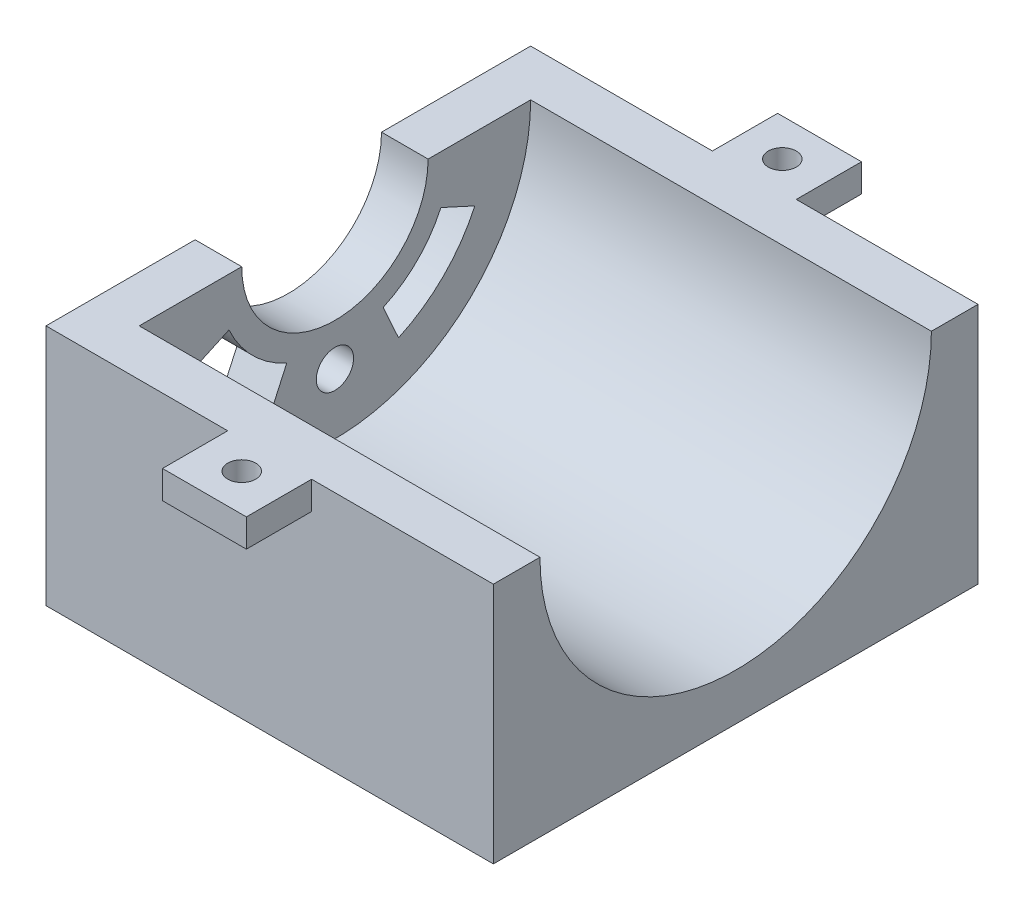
ISO-10303-21;
HEADER;
FILE_DESCRIPTION(('STEP AP214'),'2;1');
FILE_NAME('part.step','',(''),(''),'','','');
FILE_SCHEMA(('AUTOMOTIVE_DESIGN { 1 0 10303 214 1 1 1 1 }'));
ENDSEC;
DATA;
#1=APPLICATION_CONTEXT('core data for automotive mechanical design processes');
#2=APPLICATION_PROTOCOL_DEFINITION('international standard','automotive_design',2000,#1);
#3=PRODUCT_CONTEXT('',#1,'mechanical');
#4=PRODUCT('Part','Part','',(#3));
#5=PRODUCT_RELATED_PRODUCT_CATEGORY('part','',(#4));
#6=PRODUCT_DEFINITION_FORMATION('','',#4);
#7=PRODUCT_DEFINITION_CONTEXT('part definition',#1,'design');
#8=PRODUCT_DEFINITION('design','',#6,#7);
#9=PRODUCT_DEFINITION_SHAPE('','',#8);
#10=(LENGTH_UNIT() NAMED_UNIT(*) SI_UNIT(.MILLI.,.METRE.));
#11=(NAMED_UNIT(*) PLANE_ANGLE_UNIT() SI_UNIT($,.RADIAN.));
#12=(NAMED_UNIT(*) SI_UNIT($,.STERADIAN.) SOLID_ANGLE_UNIT());
#13=UNCERTAINTY_MEASURE_WITH_UNIT(LENGTH_MEASURE(1.E-05),#10,'distance_accuracy_value','');
#14=(GEOMETRIC_REPRESENTATION_CONTEXT(3) GLOBAL_UNCERTAINTY_ASSIGNED_CONTEXT((#13)) GLOBAL_UNIT_ASSIGNED_CONTEXT((#10,
#11,#12)) REPRESENTATION_CONTEXT('',''));
#15=CARTESIAN_POINT('',(0.,0.,0.));
#16=DIRECTION('',(0.,0.,1.));
#17=DIRECTION('',(1.,0.,0.));
#18=AXIS2_PLACEMENT_3D('',#15,#16,#17);
#19=CARTESIAN_POINT('',(-27.522349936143,26.,-6.25798212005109));
#20=DIRECTION('',(0.,0.,1.));
#21=DIRECTION('',(1.,0.,0.));
#22=AXIS2_PLACEMENT_3D('',#19,#20,#21);
#23=PLANE('',#22);
#24=DIRECTION('',(0.,1.,0.));
#25=VECTOR('',#24,1.);
#26=CARTESIAN_POINT('',(-8.02234993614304,23.,-6.25798212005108));
#27=LINE('',#26,#25);
#28=CARTESIAN_POINT('',(-8.02234993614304,23.,-6.25798212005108));
#29=VERTEX_POINT('',#28);
#30=CARTESIAN_POINT('',(-8.02234993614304,26.,-6.25798212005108));
#31=VERTEX_POINT('',#30);
#32=EDGE_CURVE('E240',#29,#31,#27,.T.);
#33=ORIENTED_EDGE('',*,*,#32,.F.);
#34=DIRECTION('',(1.,0.,0.));
#35=VECTOR('',#34,1.);
#36=CARTESIAN_POINT('',(0.,23.,-6.25798212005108));
#37=LINE('',#36,#35);
#38=CARTESIAN_POINT('',(0.977650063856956,23.,-6.25798212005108));
#39=VERTEX_POINT('',#38);
#40=EDGE_CURVE('E218',#29,#39,#37,.T.);
#41=ORIENTED_EDGE('',*,*,#40,.T.);
#42=DIRECTION('',(0.,1.,0.));
#43=VECTOR('',#42,1.);
#44=CARTESIAN_POINT('',(0.977650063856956,23.,-6.25798212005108));
#45=LINE('',#44,#43);
#46=CARTESIAN_POINT('',(0.977650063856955,26.,-6.25798212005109));
#47=VERTEX_POINT('',#46);
#48=EDGE_CURVE('E221',#39,#47,#45,.T.);
#49=ORIENTED_EDGE('',*,*,#48,.T.);
#50=DIRECTION('',(-1.,0.,0.));
#51=VECTOR('',#50,1.);
#52=CARTESIAN_POINT('',(-27.522349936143,26.,-6.25798212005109));
#53=LINE('',#52,#51);
#54=CARTESIAN_POINT('',(20.477650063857,26.,-6.25798212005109));
#55=VERTEX_POINT('',#54);
#56=EDGE_CURVE('E353',#55,#47,#53,.T.);
#57=ORIENTED_EDGE('',*,*,#56,.F.);
#58=DIRECTION('',(0.,-1.,0.));
#59=VECTOR('',#58,1.);
#60=CARTESIAN_POINT('',(20.477650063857,26.,-6.25798212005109));
#61=LINE('',#60,#59);
#62=CARTESIAN_POINT('',(20.477650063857,0.,-6.25798212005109));
#63=VERTEX_POINT('',#62);
#64=EDGE_CURVE('E367',#55,#63,#61,.T.);
#65=ORIENTED_EDGE('',*,*,#64,.T.);
#66=DIRECTION('',(-1.,0.,0.));
#67=VECTOR('',#66,1.);
#68=CARTESIAN_POINT('',(-27.522349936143,0.,-6.25798212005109));
#69=LINE('',#68,#67);
#70=CARTESIAN_POINT('',(-27.522349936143,0.,-6.25798212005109));
#71=VERTEX_POINT('',#70);
#72=EDGE_CURVE('E363',#63,#71,#69,.T.);
#73=ORIENTED_EDGE('',*,*,#72,.T.);
#74=DIRECTION('',(0.,-1.,0.));
#75=VECTOR('',#74,1.);
#76=CARTESIAN_POINT('',(-27.522349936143,26.,-6.25798212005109));
#77=LINE('',#76,#75);
#78=CARTESIAN_POINT('',(-27.522349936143,26.,-6.25798212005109));
#79=VERTEX_POINT('',#78);
#80=EDGE_CURVE('E356',#79,#71,#77,.T.);
#81=ORIENTED_EDGE('',*,*,#80,.F.);
#82=EDGE_CURVE('E352',#31,#79,#53,.T.);
#83=ORIENTED_EDGE('',*,*,#82,.F.);
#84=EDGE_LOOP('',(#33,#41,#49,#57,#65,#73,#81,#83));
#85=FACE_BOUND('',#84,.T.);
#86=ADVANCED_FACE('F41',(#85),#23,.F.);
#87=CARTESIAN_POINT('',(-27.522349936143,26.,45.7420178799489));
#88=DIRECTION('',(0.,0.,-1.));
#89=DIRECTION('',(-1.,0.,0.));
#90=AXIS2_PLACEMENT_3D('',#87,#88,#89);
#91=PLANE('',#90);
#92=DIRECTION('',(0.,1.,0.));
#93=VECTOR('',#92,1.);
#94=CARTESIAN_POINT('',(0.977650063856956,23.,45.7420178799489));
#95=LINE('',#94,#93);
#96=CARTESIAN_POINT('',(0.977650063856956,23.,45.7420178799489));
#97=VERTEX_POINT('',#96);
#98=CARTESIAN_POINT('',(0.977650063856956,26.,45.7420178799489));
#99=VERTEX_POINT('',#98);
#100=EDGE_CURVE('E257',#97,#99,#95,.T.);
#101=ORIENTED_EDGE('',*,*,#100,.F.);
#102=DIRECTION('',(1.,0.,0.));
#103=VECTOR('',#102,1.);
#104=CARTESIAN_POINT('',(0.,23.,45.7420178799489));
#105=LINE('',#104,#103);
#106=CARTESIAN_POINT('',(-8.02234993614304,23.,45.7420178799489));
#107=VERTEX_POINT('',#106);
#108=EDGE_CURVE('E249',#107,#97,#105,.T.);
#109=ORIENTED_EDGE('',*,*,#108,.F.);
#110=DIRECTION('',(0.,1.,0.));
#111=VECTOR('',#110,1.);
#112=CARTESIAN_POINT('',(-8.02234993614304,23.,45.7420178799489));
#113=LINE('',#112,#111);
#114=CARTESIAN_POINT('',(-8.02234993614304,26.,45.7420178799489));
#115=VERTEX_POINT('',#114);
#116=EDGE_CURVE('E271',#107,#115,#113,.T.);
#117=ORIENTED_EDGE('',*,*,#116,.T.);
#118=DIRECTION('',(1.,0.,0.));
#119=VECTOR('',#118,1.);
#120=CARTESIAN_POINT('',(-27.522349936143,26.,45.7420178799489));
#121=LINE('',#120,#119);
#122=CARTESIAN_POINT('',(-27.522349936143,26.,45.7420178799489));
#123=VERTEX_POINT('',#122);
#124=EDGE_CURVE('E345',#123,#115,#121,.T.);
#125=ORIENTED_EDGE('',*,*,#124,.F.);
#126=DIRECTION('',(0.,-1.,0.));
#127=VECTOR('',#126,1.);
#128=CARTESIAN_POINT('',(-27.522349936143,26.,45.7420178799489));
#129=LINE('',#128,#127);
#130=CARTESIAN_POINT('',(-27.522349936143,0.,45.7420178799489));
#131=VERTEX_POINT('',#130);
#132=EDGE_CURVE('E373',#123,#131,#129,.T.);
#133=ORIENTED_EDGE('',*,*,#132,.T.);
#134=DIRECTION('',(1.,0.,0.));
#135=VECTOR('',#134,1.);
#136=CARTESIAN_POINT('',(-27.522349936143,0.,45.7420178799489));
#137=LINE('',#136,#135);
#138=CARTESIAN_POINT('',(20.477650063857,0.,45.7420178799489));
#139=VERTEX_POINT('',#138);
#140=EDGE_CURVE('E359',#131,#139,#137,.T.);
#141=ORIENTED_EDGE('',*,*,#140,.T.);
#142=DIRECTION('',(0.,-1.,0.));
#143=VECTOR('',#142,1.);
#144=CARTESIAN_POINT('',(20.477650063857,26.,45.7420178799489));
#145=LINE('',#144,#143);
#146=CARTESIAN_POINT('',(20.477650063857,26.,45.7420178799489));
#147=VERTEX_POINT('',#146);
#148=EDGE_CURVE('E370',#147,#139,#145,.T.);
#149=ORIENTED_EDGE('',*,*,#148,.F.);
#150=EDGE_CURVE('E343',#99,#147,#121,.T.);
#151=ORIENTED_EDGE('',*,*,#150,.F.);
#152=EDGE_LOOP('',(#101,#109,#117,#125,#133,#141,#149,#151));
#153=FACE_BOUND('',#152,.T.);
#154=ADVANCED_FACE('F428',(#153),#91,.F.);
#155=CARTESIAN_POINT('',(-27.522349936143,26.,-6.25798212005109));
#156=DIRECTION('',(1.,0.,0.));
#157=DIRECTION('',(0.,0.,-1.));
#158=AXIS2_PLACEMENT_3D('',#155,#156,#157);
#159=PLANE('',#158);
#160=CARTESIAN_POINT('',(-27.522349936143,26.,19.7420178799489));
#161=DIRECTION('',(-1.,0.,0.));
#162=DIRECTION('',(0.,0.,1.));
#163=AXIS2_PLACEMENT_3D('',#160,#161,#162);
#164=CIRCLE('',#163,12.5);
#165=CARTESIAN_POINT('',(-27.522349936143,20.8050877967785,8.37263411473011));
#166=VERTEX_POINT('',#165);
#167=CARTESIAN_POINT('',(-27.522349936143,14.6203631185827,14.5696040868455));
#168=VERTEX_POINT('',#167);
#169=EDGE_CURVE('E274',#166,#168,#164,.T.);
#170=ORIENTED_EDGE('',*,*,#169,.T.);
#171=DIRECTION('',(0.,-0.910370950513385,-0.413793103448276));
#172=VECTOR('',#171,1.);
#173=CARTESIAN_POINT('',(-27.522349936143,-2.98507816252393,6.56736040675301));
#174=LINE('',#173,#172);
#175=CARTESIAN_POINT('',(-27.522349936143,10.9788793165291,12.9144316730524));
#176=VERTEX_POINT('',#175);
#177=EDGE_CURVE('E284',#168,#176,#174,.T.);
#178=ORIENTED_EDGE('',*,*,#177,.T.);
#179=CARTESIAN_POINT('',(-27.522349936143,26.,19.7420178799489));
#180=DIRECTION('',(-1.,0.,0.));
#181=DIRECTION('',(0.,0.,1.));
#182=AXIS2_PLACEMENT_3D('',#179,#180,#181);
#183=CIRCLE('',#182,16.5);
#184=CARTESIAN_POINT('',(-27.522349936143,19.1427158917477,4.7344313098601));
#185=VERTEX_POINT('',#184);
#186=EDGE_CURVE('E281',#185,#176,#183,.T.);
#187=ORIENTED_EDGE('',*,*,#186,.F.);
#188=DIRECTION('',(0.,-0.415592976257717,-0.909550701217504));
#189=VECTOR('',#188,1.);
#190=CARTESIAN_POINT('',(-27.522349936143,14.0468047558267,-6.41828255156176));
#191=LINE('',#190,#189);
#192=EDGE_CURVE('E277',#166,#185,#191,.T.);
#193=ORIENTED_EDGE('',*,*,#192,.F.);
#194=EDGE_LOOP('',(#170,#178,#187,#193));
#195=FACE_BOUND('',#194,.T.);
#196=CARTESIAN_POINT('',(-27.522349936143,11.5,19.7420178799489));
#197=DIRECTION('',(-1.,0.,0.));
#198=DIRECTION('',(0.,0.,1.));
#199=AXIS2_PLACEMENT_3D('',#196,#197,#198);
#200=CIRCLE('',#199,2.);
#201=CARTESIAN_POINT('',(-27.522349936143,11.5,21.7420178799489));
#202=VERTEX_POINT('',#201);
#203=EDGE_CURVE('E290',#202,#202,#200,.T.);
#204=ORIENTED_EDGE('',*,*,#203,.F.);
#205=EDGE_LOOP('',(#204));
#206=FACE_BOUND('',#205,.T.);
#207=DIRECTION('',(0.,0.,1.));
#208=VECTOR('',#207,1.);
#209=CARTESIAN_POINT('',(-27.522349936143,26.,-6.25798212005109));
#210=LINE('',#209,#208);
#211=CARTESIAN_POINT('',(-27.522349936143,26.,29.7420178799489));
#212=VERTEX_POINT('',#211);
#213=EDGE_CURVE('E344',#212,#123,#210,.T.);
#214=ORIENTED_EDGE('',*,*,#213,.F.);
#215=CARTESIAN_POINT('',(-27.522349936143,26.,19.7420178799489));
#216=DIRECTION('',(-1.,0.,0.));
#217=DIRECTION('',(0.,0.,1.));
#218=AXIS2_PLACEMENT_3D('',#215,#216,#217);
#219=CIRCLE('',#218,10.);
#220=CARTESIAN_POINT('',(-27.522349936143,26.,9.74201787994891));
#221=VERTEX_POINT('',#220);
#222=EDGE_CURVE('E319',#221,#212,#219,.T.);
#223=ORIENTED_EDGE('',*,*,#222,.F.);
#224=EDGE_CURVE('E340',#79,#221,#210,.T.);
#225=ORIENTED_EDGE('',*,*,#224,.F.);
#226=ORIENTED_EDGE('',*,*,#80,.T.);
#227=DIRECTION('',(0.,0.,1.));
#228=VECTOR('',#227,1.);
#229=CARTESIAN_POINT('',(-27.522349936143,0.,-6.25798212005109));
#230=LINE('',#229,#228);
#231=EDGE_CURVE('E337',#71,#131,#230,.T.);
#232=ORIENTED_EDGE('',*,*,#231,.T.);
#233=ORIENTED_EDGE('',*,*,#132,.F.);
#234=EDGE_LOOP('',(#214,#223,#225,#226,#232,#233));
#235=FACE_BOUND('',#234,.T.);
#236=CARTESIAN_POINT('',(-27.522349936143,26.,19.7420178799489));
#237=DIRECTION('',(-1.,0.,0.));
#238=DIRECTION('',(0.,0.,1.));
#239=AXIS2_PLACEMENT_3D('',#236,#237,#238);
#240=CIRCLE('',#239,12.5);
#241=CARTESIAN_POINT('',(-27.522349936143,14.6203631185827,24.9144316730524));
#242=VERTEX_POINT('',#241);
#243=CARTESIAN_POINT('',(-27.522349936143,20.8050877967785,31.1114016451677));
#244=VERTEX_POINT('',#243);
#245=EDGE_CURVE('E268',#242,#244,#240,.T.);
#246=ORIENTED_EDGE('',*,*,#245,.T.);
#247=DIRECTION('',(0.,-0.415592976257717,0.909550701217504));
#248=VECTOR('',#247,1.);
#249=CARTESIAN_POINT('',(-27.522349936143,28.9718841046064,13.2378673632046));
#250=LINE('',#249,#248);
#251=CARTESIAN_POINT('',(-27.522349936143,19.1427158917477,34.7496044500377));
#252=VERTEX_POINT('',#251);
#253=EDGE_CURVE('E305',#244,#252,#250,.T.);
#254=ORIENTED_EDGE('',*,*,#253,.T.);
#255=CARTESIAN_POINT('',(-27.522349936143,26.,19.7420178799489));
#256=DIRECTION('',(-1.,0.,0.));
#257=DIRECTION('',(0.,0.,1.));
#258=AXIS2_PLACEMENT_3D('',#255,#256,#257);
#259=CIRCLE('',#258,16.5);
#260=CARTESIAN_POINT('',(-27.522349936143,10.9788793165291,26.5696040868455));
#261=VERTEX_POINT('',#260);
#262=EDGE_CURVE('E302',#261,#252,#259,.T.);
#263=ORIENTED_EDGE('',*,*,#262,.F.);
#264=DIRECTION('',(0.,-0.910370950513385,0.413793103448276));
#265=VECTOR('',#264,1.);
#266=CARTESIAN_POINT('',(-27.522349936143,11.8887642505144,26.1560318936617));
#267=LINE('',#266,#265);
#268=EDGE_CURVE('E299',#242,#261,#267,.T.);
#269=ORIENTED_EDGE('',*,*,#268,.F.);
#270=EDGE_LOOP('',(#246,#254,#263,#269));
#271=FACE_BOUND('',#270,.T.);
#272=ADVANCED_FACE('F43',(#195,#206,#235,#271),#159,.F.);
#273=CARTESIAN_POINT('',(-22.522349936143,0.,0.));
#274=DIRECTION('',(1.,0.,0.));
#275=DIRECTION('',(0.,0.,-1.));
#276=AXIS2_PLACEMENT_3D('',#273,#274,#275);
#277=PLANE('',#276);
#278=CARTESIAN_POINT('',(-22.522349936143,11.5,19.7420178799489));
#279=DIRECTION('',(1.,0.,0.));
#280=DIRECTION('',(0.,0.,-1.));
#281=AXIS2_PLACEMENT_3D('',#278,#279,#280);
#282=CIRCLE('',#281,2.);
#283=CARTESIAN_POINT('',(-22.522349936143,11.5,17.7420178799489));
#284=VERTEX_POINT('',#283);
#285=EDGE_CURVE('E318',#284,#284,#282,.T.);
#286=ORIENTED_EDGE('',*,*,#285,.F.);
#287=EDGE_LOOP('',(#286));
#288=FACE_BOUND('',#287,.T.);
#289=CARTESIAN_POINT('',(-22.522349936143,26.,19.7420178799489));
#290=DIRECTION('',(1.,0.,0.));
#291=DIRECTION('',(0.,0.,-1.));
#292=AXIS2_PLACEMENT_3D('',#289,#290,#291);
#293=CIRCLE('',#292,10.);
#294=CARTESIAN_POINT('',(-22.522349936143,26.,29.7420178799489));
#295=VERTEX_POINT('',#294);
#296=CARTESIAN_POINT('',(-22.522349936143,26.,9.74201787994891));
#297=VERTEX_POINT('',#296);
#298=EDGE_CURVE('E376',#295,#297,#293,.T.);
#299=ORIENTED_EDGE('',*,*,#298,.F.);
#300=DIRECTION('',(0.,0.,1.));
#301=VECTOR('',#300,1.);
#302=CARTESIAN_POINT('',(-22.522349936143,26.,0.));
#303=LINE('',#302,#301);
#304=CARTESIAN_POINT('',(-22.522349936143,26.,40.7420178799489));
#305=VERTEX_POINT('',#304);
#306=EDGE_CURVE('E329',#295,#305,#303,.T.);
#307=ORIENTED_EDGE('',*,*,#306,.T.);
#308=CARTESIAN_POINT('',(-22.522349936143,26.,19.7420178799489));
#309=DIRECTION('',(1.,0.,0.));
#310=DIRECTION('',(0.,0.,-1.));
#311=AXIS2_PLACEMENT_3D('',#308,#309,#310);
#312=CIRCLE('',#311,21.);
#313=CARTESIAN_POINT('',(-22.522349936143,26.,-1.2579821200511));
#314=VERTEX_POINT('',#313);
#315=EDGE_CURVE('E327',#305,#314,#312,.T.);
#316=ORIENTED_EDGE('',*,*,#315,.T.);
#317=EDGE_CURVE('E330',#314,#297,#303,.T.);
#318=ORIENTED_EDGE('',*,*,#317,.T.);
#319=EDGE_LOOP('',(#299,#307,#316,#318));
#320=FACE_BOUND('',#319,.T.);
#321=DIRECTION('',(0.,0.910370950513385,0.413793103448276));
#322=VECTOR('',#321,1.);
#323=CARTESIAN_POINT('',(-22.522349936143,-2.98507816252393,6.56736040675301));
#324=LINE('',#323,#322);
#325=CARTESIAN_POINT('',(-22.522349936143,10.9788793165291,12.9144316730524));
#326=VERTEX_POINT('',#325);
#327=CARTESIAN_POINT('',(-22.522349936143,14.6203631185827,14.5696040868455));
#328=VERTEX_POINT('',#327);
#329=EDGE_CURVE('E385',#326,#328,#324,.T.);
#330=ORIENTED_EDGE('',*,*,#329,.T.);
#331=CARTESIAN_POINT('',(-22.522349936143,26.,19.7420178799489));
#332=DIRECTION('',(1.,0.,0.));
#333=DIRECTION('',(0.,0.,-1.));
#334=AXIS2_PLACEMENT_3D('',#331,#332,#333);
#335=CIRCLE('',#334,12.5);
#336=CARTESIAN_POINT('',(-22.522349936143,20.8050877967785,8.37263411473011));
#337=VERTEX_POINT('',#336);
#338=EDGE_CURVE('E388',#328,#337,#335,.T.);
#339=ORIENTED_EDGE('',*,*,#338,.T.);
#340=DIRECTION('',(0.,0.415592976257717,0.909550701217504));
#341=VECTOR('',#340,1.);
#342=CARTESIAN_POINT('',(-22.522349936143,14.0468047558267,-6.41828255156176));
#343=LINE('',#342,#341);
#344=CARTESIAN_POINT('',(-22.522349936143,19.1427158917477,4.7344313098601));
#345=VERTEX_POINT('',#344);
#346=EDGE_CURVE('E378',#345,#337,#343,.T.);
#347=ORIENTED_EDGE('',*,*,#346,.F.);
#348=CARTESIAN_POINT('',(-22.522349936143,26.,19.7420178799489));
#349=DIRECTION('',(1.,0.,0.));
#350=DIRECTION('',(0.,0.,-1.));
#351=AXIS2_PLACEMENT_3D('',#348,#349,#350);
#352=CIRCLE('',#351,16.5);
#353=EDGE_CURVE('E382',#326,#345,#352,.T.);
#354=ORIENTED_EDGE('',*,*,#353,.F.);
#355=EDGE_LOOP('',(#330,#339,#347,#354));
#356=FACE_BOUND('',#355,.T.);
#357=DIRECTION('',(0.,0.415592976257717,-0.909550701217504));
#358=VECTOR('',#357,1.);
#359=CARTESIAN_POINT('',(-22.522349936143,28.9718841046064,13.2378673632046));
#360=LINE('',#359,#358);
#361=CARTESIAN_POINT('',(-22.522349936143,19.1427158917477,34.7496044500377));
#362=VERTEX_POINT('',#361);
#363=CARTESIAN_POINT('',(-22.522349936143,20.8050877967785,31.1114016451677));
#364=VERTEX_POINT('',#363);
#365=EDGE_CURVE('E49',#362,#364,#360,.T.);
#366=ORIENTED_EDGE('',*,*,#365,.T.);
#367=CARTESIAN_POINT('',(-22.522349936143,26.,19.7420178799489));
#368=DIRECTION('',(1.,0.,0.));
#369=DIRECTION('',(0.,0.,-1.));
#370=AXIS2_PLACEMENT_3D('',#367,#368,#369);
#371=CIRCLE('',#370,12.5);
#372=CARTESIAN_POINT('',(-22.522349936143,14.6203631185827,24.9144316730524));
#373=VERTEX_POINT('',#372);
#374=EDGE_CURVE('E11',#364,#373,#371,.T.);
#375=ORIENTED_EDGE('',*,*,#374,.T.);
#376=DIRECTION('',(0.,0.910370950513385,-0.413793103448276));
#377=VECTOR('',#376,1.);
#378=CARTESIAN_POINT('',(-22.522349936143,11.8887642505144,26.1560318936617));
#379=LINE('',#378,#377);
#380=CARTESIAN_POINT('',(-22.522349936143,10.9788793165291,26.5696040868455));
#381=VERTEX_POINT('',#380);
#382=EDGE_CURVE('E391',#381,#373,#379,.T.);
#383=ORIENTED_EDGE('',*,*,#382,.F.);
#384=CARTESIAN_POINT('',(-22.522349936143,26.,19.7420178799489));
#385=DIRECTION('',(1.,0.,0.));
#386=DIRECTION('',(0.,0.,-1.));
#387=AXIS2_PLACEMENT_3D('',#384,#385,#386);
#388=CIRCLE('',#387,16.5);
#389=EDGE_CURVE('E393',#362,#381,#388,.T.);
#390=ORIENTED_EDGE('',*,*,#389,.F.);
#391=EDGE_LOOP('',(#366,#375,#383,#390));
#392=FACE_BOUND('',#391,.T.);
#393=ADVANCED_FACE('F398',(#288,#320,#356,#392),#277,.T.);
#394=CARTESIAN_POINT('',(0.,26.,0.));
#395=DIRECTION('',(0.,1.,0.));
#396=DIRECTION('',(0.,0.,1.));
#397=AXIS2_PLACEMENT_3D('',#394,#395,#396);
#398=PLANE('',#397);
#399=DIRECTION('',(-1.,0.,0.));
#400=VECTOR('',#399,1.);
#401=CARTESIAN_POINT('',(20.477650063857,26.,9.7420178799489));
#402=LINE('',#401,#400);
#403=EDGE_CURVE('E321',#297,#221,#402,.T.);
#404=ORIENTED_EDGE('',*,*,#403,.F.);
#405=ORIENTED_EDGE('',*,*,#317,.F.);
#406=DIRECTION('',(1.,0.,0.));
#407=VECTOR('',#406,1.);
#408=CARTESIAN_POINT('',(-22.522349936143,26.,-1.2579821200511));
#409=LINE('',#408,#407);
#410=CARTESIAN_POINT('',(20.477650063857,26.,-1.2579821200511));
#411=VERTEX_POINT('',#410);
#412=EDGE_CURVE('E333',#314,#411,#409,.T.);
#413=ORIENTED_EDGE('',*,*,#412,.T.);
#414=DIRECTION('',(0.,0.,-1.));
#415=VECTOR('',#414,1.);
#416=CARTESIAN_POINT('',(20.477650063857,26.,-6.25798212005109));
#417=LINE('',#416,#415);
#418=EDGE_CURVE('E348',#411,#55,#417,.T.);
#419=ORIENTED_EDGE('',*,*,#418,.T.);
#420=ORIENTED_EDGE('',*,*,#56,.T.);
#421=DIRECTION('',(0.,0.,1.));
#422=VECTOR('',#421,1.);
#423=CARTESIAN_POINT('',(0.977650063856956,26.,0.));
#424=LINE('',#423,#422);
#425=CARTESIAN_POINT('',(0.977650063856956,26.,-13.2579821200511));
#426=VERTEX_POINT('',#425);
#427=EDGE_CURVE('E56',#426,#47,#424,.T.);
#428=ORIENTED_EDGE('',*,*,#427,.F.);
#429=DIRECTION('',(1.,0.,0.));
#430=VECTOR('',#429,1.);
#431=CARTESIAN_POINT('',(0.,26.,-13.2579821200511));
#432=LINE('',#431,#430);
#433=CARTESIAN_POINT('',(-8.02234993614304,26.,-13.2579821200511));
#434=VERTEX_POINT('',#433);
#435=EDGE_CURVE('E216',#434,#426,#432,.T.);
#436=ORIENTED_EDGE('',*,*,#435,.F.);
#437=DIRECTION('',(0.,0.,1.));
#438=VECTOR('',#437,1.);
#439=CARTESIAN_POINT('',(-8.02234993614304,26.,0.));
#440=LINE('',#439,#438);
#441=EDGE_CURVE('E226',#434,#31,#440,.T.);
#442=ORIENTED_EDGE('',*,*,#441,.T.);
#443=ORIENTED_EDGE('',*,*,#82,.T.);
#444=ORIENTED_EDGE('',*,*,#224,.T.);
#445=EDGE_LOOP('',(#404,#405,#413,#419,#420,#428,#436,#442,#443,#444));
#446=FACE_BOUND('',#445,.T.);
#447=CARTESIAN_POINT('',(-3.52234993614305,26.,-9.25798212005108));
#448=DIRECTION('',(0.,1.,0.));
#449=DIRECTION('',(0.,0.,1.));
#450=AXIS2_PLACEMENT_3D('',#447,#448,#449);
#451=CIRCLE('',#450,1.5);
#452=CARTESIAN_POINT('',(-3.52234993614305,26.,-7.75798212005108));
#453=VERTEX_POINT('',#452);
#454=EDGE_CURVE('E231',#453,#453,#451,.T.);
#455=ORIENTED_EDGE('',*,*,#454,.F.);
#456=EDGE_LOOP('',(#455));
#457=FACE_BOUND('',#456,.T.);
#458=ADVANCED_FACE('F443',(#446,#457),#398,.T.);
#459=CARTESIAN_POINT('',(20.477650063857,26.,-6.25798212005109));
#460=DIRECTION('',(-1.,0.,0.));
#461=DIRECTION('',(0.,0.,1.));
#462=AXIS2_PLACEMENT_3D('',#459,#460,#461);
#463=PLANE('',#462);
#464=ORIENTED_EDGE('',*,*,#418,.F.);
#465=CARTESIAN_POINT('',(20.477650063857,26.,19.7420178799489));
#466=DIRECTION('',(1.,0.,0.));
#467=DIRECTION('',(0.,0.,-1.));
#468=AXIS2_PLACEMENT_3D('',#465,#466,#467);
#469=CIRCLE('',#468,21.);
#470=CARTESIAN_POINT('',(20.477650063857,26.,40.7420178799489));
#471=VERTEX_POINT('',#470);
#472=EDGE_CURVE('E325',#471,#411,#469,.T.);
#473=ORIENTED_EDGE('',*,*,#472,.F.);
#474=EDGE_CURVE('E349',#147,#471,#417,.T.);
#475=ORIENTED_EDGE('',*,*,#474,.F.);
#476=ORIENTED_EDGE('',*,*,#148,.T.);
#477=DIRECTION('',(0.,0.,-1.));
#478=VECTOR('',#477,1.);
#479=CARTESIAN_POINT('',(20.477650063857,0.,-6.25798212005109));
#480=LINE('',#479,#478);
#481=EDGE_CURVE('E361',#139,#63,#480,.T.);
#482=ORIENTED_EDGE('',*,*,#481,.T.);
#483=ORIENTED_EDGE('',*,*,#64,.F.);
#484=EDGE_LOOP('',(#464,#473,#475,#476,#482,#483));
#485=FACE_BOUND('',#484,.T.);
#486=ADVANCED_FACE('F440',(#485),#463,.F.);
#487=DIRECTION('',(-1.,0.,0.));
#488=VECTOR('',#487,1.);
#489=CARTESIAN_POINT('',(20.477650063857,26.,29.7420178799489));
#490=LINE('',#489,#488);
#491=EDGE_CURVE('E322',#295,#212,#490,.T.);
#492=ORIENTED_EDGE('',*,*,#491,.T.);
#493=ORIENTED_EDGE('',*,*,#213,.T.);
#494=ORIENTED_EDGE('',*,*,#124,.T.);
#495=DIRECTION('',(0.,0.,1.));
#496=VECTOR('',#495,1.);
#497=CARTESIAN_POINT('',(-8.02234993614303,26.,0.));
#498=LINE('',#497,#496);
#499=CARTESIAN_POINT('',(-8.02234993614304,26.,52.7420178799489));
#500=VERTEX_POINT('',#499);
#501=EDGE_CURVE('E64',#115,#500,#498,.T.);
#502=ORIENTED_EDGE('',*,*,#501,.T.);
#503=DIRECTION('',(1.,0.,0.));
#504=VECTOR('',#503,1.);
#505=CARTESIAN_POINT('',(0.,26.,52.7420178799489));
#506=LINE('',#505,#504);
#507=CARTESIAN_POINT('',(0.977650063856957,26.,52.7420178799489));
#508=VERTEX_POINT('',#507);
#509=EDGE_CURVE('E247',#500,#508,#506,.T.);
#510=ORIENTED_EDGE('',*,*,#509,.T.);
#511=DIRECTION('',(0.,0.,1.));
#512=VECTOR('',#511,1.);
#513=CARTESIAN_POINT('',(0.977650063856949,26.,0.));
#514=LINE('',#513,#512);
#515=EDGE_CURVE('E260',#99,#508,#514,.T.);
#516=ORIENTED_EDGE('',*,*,#515,.F.);
#517=ORIENTED_EDGE('',*,*,#150,.T.);
#518=ORIENTED_EDGE('',*,*,#474,.T.);
#519=DIRECTION('',(1.,0.,0.));
#520=VECTOR('',#519,1.);
#521=CARTESIAN_POINT('',(-22.522349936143,26.,40.7420178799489));
#522=LINE('',#521,#520);
#523=EDGE_CURVE('E335',#305,#471,#522,.T.);
#524=ORIENTED_EDGE('',*,*,#523,.F.);
#525=ORIENTED_EDGE('',*,*,#306,.F.);
#526=EDGE_LOOP('',(#492,#493,#494,#502,#510,#516,#517,#518,#524,#525));
#527=FACE_BOUND('',#526,.T.);
#528=CARTESIAN_POINT('',(-3.52234993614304,26.,48.7420178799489));
#529=DIRECTION('',(0.,1.,0.));
#530=DIRECTION('',(0.,0.,1.));
#531=AXIS2_PLACEMENT_3D('',#528,#529,#530);
#532=CIRCLE('',#531,1.5);
#533=CARTESIAN_POINT('',(-3.52234993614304,26.,50.2420178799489));
#534=VERTEX_POINT('',#533);
#535=EDGE_CURVE('E239',#534,#534,#532,.T.);
#536=ORIENTED_EDGE('',*,*,#535,.F.);
#537=EDGE_LOOP('',(#536));
#538=FACE_BOUND('',#537,.T.);
#539=ADVANCED_FACE('F442',(#527,#538),#398,.T.);
#540=CARTESIAN_POINT('',(0.,0.,0.));
#541=DIRECTION('',(0.,1.,0.));
#542=DIRECTION('',(0.,0.,1.));
#543=AXIS2_PLACEMENT_3D('',#540,#541,#542);
#544=PLANE('',#543);
#545=ORIENTED_EDGE('',*,*,#231,.F.);
#546=ORIENTED_EDGE('',*,*,#72,.F.);
#547=ORIENTED_EDGE('',*,*,#481,.F.);
#548=ORIENTED_EDGE('',*,*,#140,.F.);
#549=EDGE_LOOP('',(#545,#546,#547,#548));
#550=FACE_BOUND('',#549,.T.);
#551=ADVANCED_FACE('F438',(#550),#544,.F.);
#552=CARTESIAN_POINT('',(-22.522349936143,26.,19.7420178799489));
#553=DIRECTION('',(1.,0.,0.));
#554=DIRECTION('',(0.,0.,-1.));
#555=AXIS2_PLACEMENT_3D('',#552,#553,#554);
#556=CYLINDRICAL_SURFACE('',#555,21.);
#557=ORIENTED_EDGE('',*,*,#472,.T.);
#558=ORIENTED_EDGE('',*,*,#412,.F.);
#559=ORIENTED_EDGE('',*,*,#315,.F.);
#560=ORIENTED_EDGE('',*,*,#523,.T.);
#561=EDGE_LOOP('',(#557,#558,#559,#560));
#562=FACE_BOUND('',#561,.T.);
#563=ADVANCED_FACE('F462',(#562),#556,.F.);
#564=CARTESIAN_POINT('',(20.477650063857,26.,19.7420178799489));
#565=DIRECTION('',(-1.,0.,0.));
#566=DIRECTION('',(0.,0.,1.));
#567=AXIS2_PLACEMENT_3D('',#564,#565,#566);
#568=CYLINDRICAL_SURFACE('',#567,10.);
#569=ORIENTED_EDGE('',*,*,#298,.T.);
#570=ORIENTED_EDGE('',*,*,#403,.T.);
#571=ORIENTED_EDGE('',*,*,#222,.T.);
#572=ORIENTED_EDGE('',*,*,#491,.F.);
#573=EDGE_LOOP('',(#569,#570,#571,#572));
#574=FACE_BOUND('',#573,.T.);
#575=ADVANCED_FACE('F537',(#574),#568,.F.);
#576=CARTESIAN_POINT('',(20.477650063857,11.5,19.7420178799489));
#577=DIRECTION('',(-1.,0.,0.));
#578=DIRECTION('',(0.,0.,1.));
#579=AXIS2_PLACEMENT_3D('',#576,#577,#578);
#580=CYLINDRICAL_SURFACE('',#579,2.);
#581=ORIENTED_EDGE('',*,*,#285,.T.);
#582=EDGE_LOOP('',(#581));
#583=FACE_BOUND('',#582,.T.);
#584=ORIENTED_EDGE('',*,*,#203,.T.);
#585=EDGE_LOOP('',(#584));
#586=FACE_BOUND('',#585,.T.);
#587=ADVANCED_FACE('F526',(#583,#586),#580,.F.);
#588=CARTESIAN_POINT('',(20.477650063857,26.,19.7420178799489));
#589=DIRECTION('',(-1.,0.,0.));
#590=DIRECTION('',(0.,0.,1.));
#591=AXIS2_PLACEMENT_3D('',#588,#589,#590);
#592=CYLINDRICAL_SURFACE('',#591,12.5);
#593=DIRECTION('',(-1.,0.,0.));
#594=VECTOR('',#593,1.);
#595=CARTESIAN_POINT('',(20.477650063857,14.6203631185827,14.5696040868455));
#596=LINE('',#595,#594);
#597=EDGE_CURVE('E288',#328,#168,#596,.T.);
#598=ORIENTED_EDGE('',*,*,#597,.T.);
#599=ORIENTED_EDGE('',*,*,#169,.F.);
#600=DIRECTION('',(-1.,0.,0.));
#601=VECTOR('',#600,1.);
#602=CARTESIAN_POINT('',(20.477650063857,20.8050877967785,8.37263411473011));
#603=LINE('',#602,#601);
#604=EDGE_CURVE('E287',#337,#166,#603,.T.);
#605=ORIENTED_EDGE('',*,*,#604,.F.);
#606=ORIENTED_EDGE('',*,*,#338,.F.);
#607=EDGE_LOOP('',(#598,#599,#605,#606));
#608=FACE_BOUND('',#607,.T.);
#609=ADVANCED_FACE('F515',(#608),#592,.T.);
#610=CARTESIAN_POINT('',(20.477650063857,-2.98507816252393,6.56736040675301));
#611=DIRECTION('',(0.,0.413793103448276,-0.910370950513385));
#612=DIRECTION('',(0.,0.910370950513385,0.413793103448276));
#613=AXIS2_PLACEMENT_3D('',#610,#611,#612);
#614=PLANE('',#613);
#615=DIRECTION('',(-1.,0.,0.));
#616=VECTOR('',#615,1.);
#617=CARTESIAN_POINT('',(20.477650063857,10.9788793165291,12.9144316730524));
#618=LINE('',#617,#616);
#619=EDGE_CURVE('E291',#326,#176,#618,.T.);
#620=ORIENTED_EDGE('',*,*,#619,.T.);
#621=ORIENTED_EDGE('',*,*,#177,.F.);
#622=ORIENTED_EDGE('',*,*,#597,.F.);
#623=ORIENTED_EDGE('',*,*,#329,.F.);
#624=EDGE_LOOP('',(#620,#621,#622,#623));
#625=FACE_BOUND('',#624,.T.);
#626=ADVANCED_FACE('F511',(#625),#614,.T.);
#627=CARTESIAN_POINT('',(20.477650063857,26.,19.7420178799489));
#628=DIRECTION('',(-1.,0.,0.));
#629=DIRECTION('',(0.,0.,1.));
#630=AXIS2_PLACEMENT_3D('',#627,#628,#629);
#631=CYLINDRICAL_SURFACE('',#630,16.5);
#632=ORIENTED_EDGE('',*,*,#353,.T.);
#633=DIRECTION('',(-1.,0.,0.));
#634=VECTOR('',#633,1.);
#635=CARTESIAN_POINT('',(20.477650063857,19.1427158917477,4.7344313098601));
#636=LINE('',#635,#634);
#637=EDGE_CURVE('E293',#345,#185,#636,.T.);
#638=ORIENTED_EDGE('',*,*,#637,.T.);
#639=ORIENTED_EDGE('',*,*,#186,.T.);
#640=ORIENTED_EDGE('',*,*,#619,.F.);
#641=EDGE_LOOP('',(#632,#638,#639,#640));
#642=FACE_BOUND('',#641,.T.);
#643=ADVANCED_FACE('F514',(#642),#631,.F.);
#644=CARTESIAN_POINT('',(20.477650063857,14.0468047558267,-6.41828255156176));
#645=DIRECTION('',(0.,0.909550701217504,-0.415592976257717));
#646=DIRECTION('',(0.,0.415592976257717,0.909550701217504));
#647=AXIS2_PLACEMENT_3D('',#644,#645,#646);
#648=PLANE('',#647);
#649=ORIENTED_EDGE('',*,*,#346,.T.);
#650=ORIENTED_EDGE('',*,*,#604,.T.);
#651=ORIENTED_EDGE('',*,*,#192,.T.);
#652=ORIENTED_EDGE('',*,*,#637,.F.);
#653=EDGE_LOOP('',(#649,#650,#651,#652));
#654=FACE_BOUND('',#653,.T.);
#655=ADVANCED_FACE('F519',(#654),#648,.F.);
#656=CARTESIAN_POINT('',(20.477650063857,26.,19.7420178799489));
#657=DIRECTION('',(-1.,0.,0.));
#658=DIRECTION('',(0.,0.,1.));
#659=AXIS2_PLACEMENT_3D('',#656,#657,#658);
#660=CYLINDRICAL_SURFACE('',#659,12.5);
#661=DIRECTION('',(-1.,0.,0.));
#662=VECTOR('',#661,1.);
#663=CARTESIAN_POINT('',(20.477650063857,20.8050877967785,31.1114016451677));
#664=LINE('',#663,#662);
#665=EDGE_CURVE('E278',#364,#244,#664,.T.);
#666=ORIENTED_EDGE('',*,*,#665,.T.);
#667=ORIENTED_EDGE('',*,*,#245,.F.);
#668=DIRECTION('',(-1.,0.,0.));
#669=VECTOR('',#668,1.);
#670=CARTESIAN_POINT('',(20.477650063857,14.6203631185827,24.9144316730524));
#671=LINE('',#670,#669);
#672=EDGE_CURVE('E308',#373,#242,#671,.T.);
#673=ORIENTED_EDGE('',*,*,#672,.F.);
#674=ORIENTED_EDGE('',*,*,#374,.F.);
#675=EDGE_LOOP('',(#666,#667,#673,#674));
#676=FACE_BOUND('',#675,.T.);
#677=ADVANCED_FACE('F412',(#676),#660,.T.);
#678=CARTESIAN_POINT('',(20.477650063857,28.9718841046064,13.2378673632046));
#679=DIRECTION('',(0.,-0.909550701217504,-0.415592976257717));
#680=DIRECTION('',(0.,0.415592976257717,-0.909550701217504));
#681=AXIS2_PLACEMENT_3D('',#678,#679,#680);
#682=PLANE('',#681);
#683=DIRECTION('',(-1.,0.,0.));
#684=VECTOR('',#683,1.);
#685=CARTESIAN_POINT('',(20.477650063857,19.1427158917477,34.7496044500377));
#686=LINE('',#685,#684);
#687=EDGE_CURVE('E310',#362,#252,#686,.T.);
#688=ORIENTED_EDGE('',*,*,#687,.T.);
#689=ORIENTED_EDGE('',*,*,#253,.F.);
#690=ORIENTED_EDGE('',*,*,#665,.F.);
#691=ORIENTED_EDGE('',*,*,#365,.F.);
#692=EDGE_LOOP('',(#688,#689,#690,#691));
#693=FACE_BOUND('',#692,.T.);
#694=ADVANCED_FACE('F403',(#693),#682,.T.);
#695=CARTESIAN_POINT('',(20.477650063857,26.,19.7420178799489));
#696=DIRECTION('',(-1.,0.,0.));
#697=DIRECTION('',(0.,0.,1.));
#698=AXIS2_PLACEMENT_3D('',#695,#696,#697);
#699=CYLINDRICAL_SURFACE('',#698,16.5);
#700=ORIENTED_EDGE('',*,*,#389,.T.);
#701=DIRECTION('',(-1.,0.,0.));
#702=VECTOR('',#701,1.);
#703=CARTESIAN_POINT('',(20.477650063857,10.9788793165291,26.5696040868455));
#704=LINE('',#703,#702);
#705=EDGE_CURVE('E312',#381,#261,#704,.T.);
#706=ORIENTED_EDGE('',*,*,#705,.T.);
#707=ORIENTED_EDGE('',*,*,#262,.T.);
#708=ORIENTED_EDGE('',*,*,#687,.F.);
#709=EDGE_LOOP('',(#700,#706,#707,#708));
#710=FACE_BOUND('',#709,.T.);
#711=ADVANCED_FACE('F406',(#710),#699,.F.);
#712=CARTESIAN_POINT('',(20.477650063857,11.8887642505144,26.1560318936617));
#713=DIRECTION('',(0.,-0.413793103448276,-0.910370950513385));
#714=DIRECTION('',(0.,0.910370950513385,-0.413793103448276));
#715=AXIS2_PLACEMENT_3D('',#712,#713,#714);
#716=PLANE('',#715);
#717=ORIENTED_EDGE('',*,*,#382,.T.);
#718=ORIENTED_EDGE('',*,*,#672,.T.);
#719=ORIENTED_EDGE('',*,*,#268,.T.);
#720=ORIENTED_EDGE('',*,*,#705,.F.);
#721=EDGE_LOOP('',(#717,#718,#719,#720));
#722=FACE_BOUND('',#721,.T.);
#723=ADVANCED_FACE('F414',(#722),#716,.F.);
#724=CARTESIAN_POINT('',(0.977650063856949,23.,0.));
#725=DIRECTION('',(-1.,0.,0.));
#726=DIRECTION('',(0.,0.,1.));
#727=AXIS2_PLACEMENT_3D('',#724,#725,#726);
#728=PLANE('',#727);
#729=ORIENTED_EDGE('',*,*,#515,.T.);
#730=DIRECTION('',(0.,1.,0.));
#731=VECTOR('',#730,1.);
#732=CARTESIAN_POINT('',(0.977650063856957,23.,52.7420178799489));
#733=LINE('',#732,#731);
#734=CARTESIAN_POINT('',(0.977650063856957,23.,52.7420178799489));
#735=VERTEX_POINT('',#734);
#736=EDGE_CURVE('E266',#735,#508,#733,.T.);
#737=ORIENTED_EDGE('',*,*,#736,.F.);
#738=DIRECTION('',(0.,0.,1.));
#739=VECTOR('',#738,1.);
#740=CARTESIAN_POINT('',(0.977650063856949,23.,0.));
#741=LINE('',#740,#739);
#742=EDGE_CURVE('E246',#97,#735,#741,.T.);
#743=ORIENTED_EDGE('',*,*,#742,.F.);
#744=ORIENTED_EDGE('',*,*,#100,.T.);
#745=EDGE_LOOP('',(#729,#737,#743,#744));
#746=FACE_BOUND('',#745,.T.);
#747=ADVANCED_FACE('F416',(#746),#728,.F.);
#748=CARTESIAN_POINT('',(0.,23.,52.7420178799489));
#749=DIRECTION('',(0.,0.,1.));
#750=DIRECTION('',(1.,0.,0.));
#751=AXIS2_PLACEMENT_3D('',#748,#749,#750);
#752=PLANE('',#751);
#753=ORIENTED_EDGE('',*,*,#509,.F.);
#754=DIRECTION('',(0.,1.,0.));
#755=VECTOR('',#754,1.);
#756=CARTESIAN_POINT('',(-8.02234993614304,23.,52.7420178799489));
#757=LINE('',#756,#755);
#758=CARTESIAN_POINT('',(-8.02234993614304,23.,52.7420178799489));
#759=VERTEX_POINT('',#758);
#760=EDGE_CURVE('E269',#759,#500,#757,.T.);
#761=ORIENTED_EDGE('',*,*,#760,.F.);
#762=DIRECTION('',(1.,0.,0.));
#763=VECTOR('',#762,1.);
#764=CARTESIAN_POINT('',(0.,23.,52.7420178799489));
#765=LINE('',#764,#763);
#766=EDGE_CURVE('E254',#759,#735,#765,.T.);
#767=ORIENTED_EDGE('',*,*,#766,.T.);
#768=ORIENTED_EDGE('',*,*,#736,.T.);
#769=EDGE_LOOP('',(#753,#761,#767,#768));
#770=FACE_BOUND('',#769,.T.);
#771=ADVANCED_FACE('F422',(#770),#752,.T.);
#772=CARTESIAN_POINT('',(-8.02234993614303,23.,0.));
#773=DIRECTION('',(-1.,0.,0.));
#774=DIRECTION('',(0.,0.,1.));
#775=AXIS2_PLACEMENT_3D('',#772,#773,#774);
#776=PLANE('',#775);
#777=ORIENTED_EDGE('',*,*,#501,.F.);
#778=ORIENTED_EDGE('',*,*,#116,.F.);
#779=DIRECTION('',(0.,0.,1.));
#780=VECTOR('',#779,1.);
#781=CARTESIAN_POINT('',(-8.02234993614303,23.,0.));
#782=LINE('',#781,#780);
#783=EDGE_CURVE('E251',#107,#759,#782,.T.);
#784=ORIENTED_EDGE('',*,*,#783,.T.);
#785=ORIENTED_EDGE('',*,*,#760,.T.);
#786=EDGE_LOOP('',(#777,#778,#784,#785));
#787=FACE_BOUND('',#786,.T.);
#788=ADVANCED_FACE('F504',(#787),#776,.T.);
#789=CARTESIAN_POINT('',(-3.52234993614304,23.,48.7420178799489));
#790=DIRECTION('',(0.,1.,0.));
#791=DIRECTION('',(0.,0.,1.));
#792=AXIS2_PLACEMENT_3D('',#789,#790,#791);
#793=CYLINDRICAL_SURFACE('',#792,1.5);
#794=CARTESIAN_POINT('',(-3.52234993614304,23.,48.7420178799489));
#795=DIRECTION('',(0.,1.,0.));
#796=DIRECTION('',(0.,0.,1.));
#797=AXIS2_PLACEMENT_3D('',#794,#795,#796);
#798=CIRCLE('',#797,1.5);
#799=CARTESIAN_POINT('',(-3.52234993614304,23.,50.2420178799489));
#800=VERTEX_POINT('',#799);
#801=EDGE_CURVE('E243',#800,#800,#798,.T.);
#802=ORIENTED_EDGE('',*,*,#801,.F.);
#803=EDGE_LOOP('',(#802));
#804=FACE_BOUND('',#803,.T.);
#805=ORIENTED_EDGE('',*,*,#535,.T.);
#806=EDGE_LOOP('',(#805));
#807=FACE_BOUND('',#806,.T.);
#808=ADVANCED_FACE('F500',(#804,#807),#793,.F.);
#809=CARTESIAN_POINT('',(0.,23.,0.));
#810=DIRECTION('',(0.,1.,0.));
#811=DIRECTION('',(0.,0.,1.));
#812=AXIS2_PLACEMENT_3D('',#809,#810,#811);
#813=PLANE('',#812);
#814=ORIENTED_EDGE('',*,*,#801,.T.);
#815=EDGE_LOOP('',(#814));
#816=FACE_BOUND('',#815,.T.);
#817=ORIENTED_EDGE('',*,*,#742,.T.);
#818=ORIENTED_EDGE('',*,*,#766,.F.);
#819=ORIENTED_EDGE('',*,*,#783,.F.);
#820=ORIENTED_EDGE('',*,*,#108,.T.);
#821=EDGE_LOOP('',(#817,#818,#819,#820));
#822=FACE_BOUND('',#821,.T.);
#823=ADVANCED_FACE('F492',(#816,#822),#813,.F.);
#824=CARTESIAN_POINT('',(0.977650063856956,23.,0.));
#825=DIRECTION('',(-1.,0.,0.));
#826=DIRECTION('',(0.,0.,1.));
#827=AXIS2_PLACEMENT_3D('',#824,#825,#826);
#828=PLANE('',#827);
#829=ORIENTED_EDGE('',*,*,#427,.T.);
#830=ORIENTED_EDGE('',*,*,#48,.F.);
#831=DIRECTION('',(0.,0.,1.));
#832=VECTOR('',#831,1.);
#833=CARTESIAN_POINT('',(0.977650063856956,23.,0.));
#834=LINE('',#833,#832);
#835=CARTESIAN_POINT('',(0.977650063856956,23.,-13.2579821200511));
#836=VERTEX_POINT('',#835);
#837=EDGE_CURVE('E209',#836,#39,#834,.T.);
#838=ORIENTED_EDGE('',*,*,#837,.F.);
#839=DIRECTION('',(0.,1.,0.));
#840=VECTOR('',#839,1.);
#841=CARTESIAN_POINT('',(0.977650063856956,23.,-13.2579821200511));
#842=LINE('',#841,#840);
#843=EDGE_CURVE('E213',#836,#426,#842,.T.);
#844=ORIENTED_EDGE('',*,*,#843,.T.);
#845=EDGE_LOOP('',(#829,#830,#838,#844));
#846=FACE_BOUND('',#845,.T.);
#847=ADVANCED_FACE('F220',(#846),#828,.F.);
#848=CARTESIAN_POINT('',(-8.02234993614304,23.,0.));
#849=DIRECTION('',(-1.,0.,0.));
#850=DIRECTION('',(0.,0.,1.));
#851=AXIS2_PLACEMENT_3D('',#848,#849,#850);
#852=PLANE('',#851);
#853=ORIENTED_EDGE('',*,*,#441,.F.);
#854=DIRECTION('',(0.,1.,0.));
#855=VECTOR('',#854,1.);
#856=CARTESIAN_POINT('',(-8.02234993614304,23.,-13.2579821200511));
#857=LINE('',#856,#855);
#858=CARTESIAN_POINT('',(-8.02234993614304,23.,-13.2579821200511));
#859=VERTEX_POINT('',#858);
#860=EDGE_CURVE('E217',#859,#434,#857,.T.);
#861=ORIENTED_EDGE('',*,*,#860,.F.);
#862=DIRECTION('',(0.,0.,1.));
#863=VECTOR('',#862,1.);
#864=CARTESIAN_POINT('',(-8.02234993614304,23.,0.));
#865=LINE('',#864,#863);
#866=EDGE_CURVE('E210',#859,#29,#865,.T.);
#867=ORIENTED_EDGE('',*,*,#866,.T.);
#868=ORIENTED_EDGE('',*,*,#32,.T.);
#869=EDGE_LOOP('',(#853,#861,#867,#868));
#870=FACE_BOUND('',#869,.T.);
#871=ADVANCED_FACE('F482',(#870),#852,.T.);
#872=CARTESIAN_POINT('',(-3.52234993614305,23.,-9.25798212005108));
#873=DIRECTION('',(0.,1.,0.));
#874=DIRECTION('',(0.,0.,1.));
#875=AXIS2_PLACEMENT_3D('',#872,#873,#874);
#876=CYLINDRICAL_SURFACE('',#875,1.5);
#877=CARTESIAN_POINT('',(-3.52234993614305,23.,-9.25798212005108));
#878=DIRECTION('',(0.,1.,0.));
#879=DIRECTION('',(0.,0.,1.));
#880=AXIS2_PLACEMENT_3D('',#877,#878,#879);
#881=CIRCLE('',#880,1.5);
#882=CARTESIAN_POINT('',(-3.52234993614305,23.,-7.75798212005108));
#883=VERTEX_POINT('',#882);
#884=EDGE_CURVE('E223',#883,#883,#881,.T.);
#885=ORIENTED_EDGE('',*,*,#884,.F.);
#886=EDGE_LOOP('',(#885));
#887=FACE_BOUND('',#886,.T.);
#888=ORIENTED_EDGE('',*,*,#454,.T.);
#889=EDGE_LOOP('',(#888));
#890=FACE_BOUND('',#889,.T.);
#891=ADVANCED_FACE('F484',(#887,#890),#876,.F.);
#892=CARTESIAN_POINT('',(0.,23.,-13.2579821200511));
#893=DIRECTION('',(0.,0.,1.));
#894=DIRECTION('',(1.,0.,0.));
#895=AXIS2_PLACEMENT_3D('',#892,#893,#894);
#896=PLANE('',#895);
#897=ORIENTED_EDGE('',*,*,#435,.T.);
#898=ORIENTED_EDGE('',*,*,#843,.F.);
#899=DIRECTION('',(1.,0.,0.));
#900=VECTOR('',#899,1.);
#901=CARTESIAN_POINT('',(0.,23.,-13.2579821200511));
#902=LINE('',#901,#900);
#903=EDGE_CURVE('E204',#859,#836,#902,.T.);
#904=ORIENTED_EDGE('',*,*,#903,.F.);
#905=ORIENTED_EDGE('',*,*,#860,.T.);
#906=EDGE_LOOP('',(#897,#898,#904,#905));
#907=FACE_BOUND('',#906,.T.);
#908=ADVANCED_FACE('F214',(#907),#896,.F.);
#909=CARTESIAN_POINT('',(0.,23.,0.));
#910=DIRECTION('',(0.,1.,0.));
#911=DIRECTION('',(0.,0.,1.));
#912=AXIS2_PLACEMENT_3D('',#909,#910,#911);
#913=PLANE('',#912);
#914=ORIENTED_EDGE('',*,*,#884,.T.);
#915=EDGE_LOOP('',(#914));
#916=FACE_BOUND('',#915,.T.);
#917=ORIENTED_EDGE('',*,*,#837,.T.);
#918=ORIENTED_EDGE('',*,*,#40,.F.);
#919=ORIENTED_EDGE('',*,*,#866,.F.);
#920=ORIENTED_EDGE('',*,*,#903,.T.);
#921=EDGE_LOOP('',(#917,#918,#919,#920));
#922=FACE_BOUND('',#921,.T.);
#923=ADVANCED_FACE('F206',(#916,#922),#913,.F.);
#924=CLOSED_SHELL('',(#86,#154,#272,#393,#458,#486,#539,#551,#563,#575,#587,#609,#626,#643,#655,
#677,#694,#711,#723,#747,#771,#788,#808,#823,#847,#871,#891,#908,#923));
#925=MANIFOLD_SOLID_BREP('B2',#924);
#926=ADVANCED_BREP_SHAPE_REPRESENTATION('',(#18,#925),#14);
#927=SHAPE_DEFINITION_REPRESENTATION(#9,#926);
ENDSEC;
END-ISO-10303-21;
